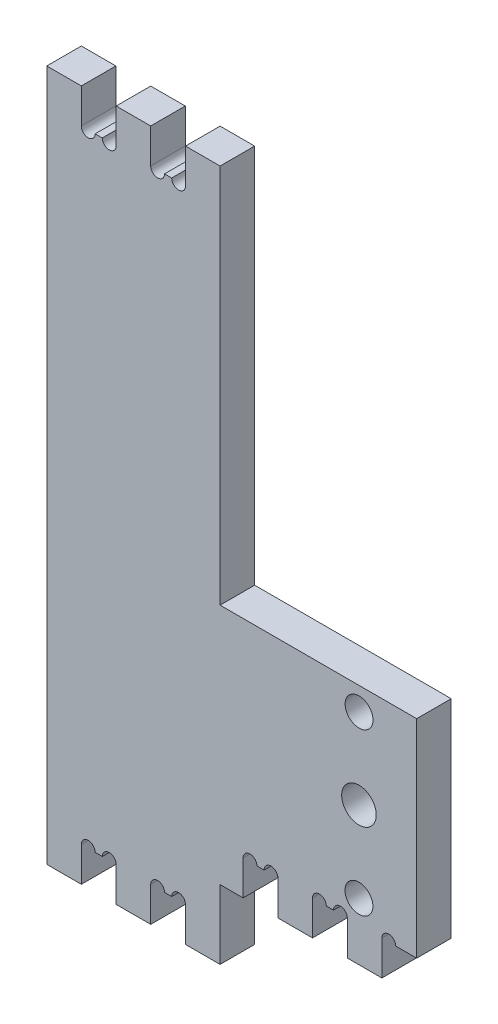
from build123d import *

# Parameters (mm, degrees)
OUTLINE_DEPTH = 15
SKIZZE2_R     = 6.05
SKIZZE2_R_2   = 7.5
INNER_DEPTH   = 15


with BuildPart() as part:
    # Skizze1 → outline (new body)
    with BuildSketch(Plane.XY):
        with BuildLine():
            Line((14.748182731, -15), (14.748182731, -40))
            Line((14.748182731, -40), (14.748182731, -45))
            Line((14.748182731, -45), (-0.251817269, -45))
            Line((-0.251817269, -45), (-0.251817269, -30))
            ThreePointArc((-0.251817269, -30), (-3.251817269, -27), (-6.251817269, -30))
            Line((-6.251817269, -30), (-9.351817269, -30))
            ThreePointArc((-9.351817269, -30), (-12.351817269, -27), (-15.351817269, -30))
            Line((-15.351817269, -30), (-15.351817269, -45))
            Line((-15.351817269, -45), (-30.351817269, -45))
            Line((-30.351817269, -45), (-30.351817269, -30))
            ThreePointArc((-30.351817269, -30), (-33.351817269, -27), (-36.351817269, -30))
            Line((-36.351817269, -30), (-39.451817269, -30))
            ThreePointArc((-39.451817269, -30), (-42.451817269, -27), (-45.451817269, -30))
            Line((-45.451817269, -30), (-45.451817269, -45))
            Line((-45.451817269, -45), (-60.451817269, -45))
            Line((-60.451817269, -45), (-60.451817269, -40))
            Line((-60.451817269, -40), (-60.451817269, 160))
            Line((-60.451817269, 160), (-60.451817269, 255))
            Line((-60.451817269, 255), (-45.451817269, 255))
            Line((-45.451817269, 255), (-45.451817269, 240))
            ThreePointArc((-45.451817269, 240), (-42.451817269, 237), (-39.451817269, 240))
            Line((-39.451817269, 240), (-36.351817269, 240))
            ThreePointArc((-36.351817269, 240), (-33.351817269, 237), (-30.351817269, 240))
            Line((-30.351817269, 240), (-30.351817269, 255))
            Line((-30.351817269, 255), (-15.351817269, 255))
            Line((-15.351817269, 255), (-15.351817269, 240))
            ThreePointArc((-15.351817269, 240), (-12.351817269, 237), (-9.351817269, 240))
            Line((-9.351817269, 240), (-6.251817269, 240))
            ThreePointArc((-6.251817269, 240), (-3.251817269, 237), (-0.251817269, 240))
            Line((-0.251817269, 240), (-0.251817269, 255))
            Line((-0.251817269, 255), (14.748182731, 255))
            Line((14.748182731, 255), (14.748182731, 240))
            Line((14.748182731, 240), (14.748182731, 90))
            Line((14.748182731, 90), (100.048182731, 90))
            Line((100.048182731, 90), (100.048182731, 0))
            Line((100.048182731, 0), (90.948182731, 0))
            ThreePointArc((90.948182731, 0), (87.948182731, 3), (84.948182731, 0))
            Line((84.948182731, 0), (84.948182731, -15))
            Line((84.948182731, -15), (69.948182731, -15))
            Line((69.948182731, -15), (69.948182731, 0))
            ThreePointArc((69.948182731, 0), (66.948182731, 3), (63.948182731, 0))
            Line((63.948182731, 0), (60.848182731, 0))
            ThreePointArc((60.848182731, 0), (57.848182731, 3), (54.848182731, 0))
            Line((54.848182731, 0), (54.848182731, -15))
            Line((54.848182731, -15), (39.848182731, -15))
            Line((39.848182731, -15), (39.848182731, 0))
            ThreePointArc((39.848182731, 0), (36.848182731, 3), (33.848182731, 0))
            Line((33.848182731, 0), (30.748182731, 0))
            ThreePointArc((30.748182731, 0), (27.748182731, 3), (24.748182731, 0))
            Line((24.748182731, 0), (24.748182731, -15))
            Line((24.748182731, -15), (14.748182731, -15))
        make_face()
    extrude(amount=OUTLINE_DEPTH)

    # Skizze2 → inner (cut)
    with BuildSketch(Plane.XY.offset(15)):
        with Locations((75.048182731, 80)):
            Circle(SKIZZE2_R)
        with Locations((75.000000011, 45.000016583)):
            Circle(SKIZZE2_R_2)
        with Locations((75.000000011, 10.000016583)):
            Circle(SKIZZE2_R)
    extrude(amount=-INNER_DEPTH, mode=Mode.SUBTRACT)


solid = part.part
